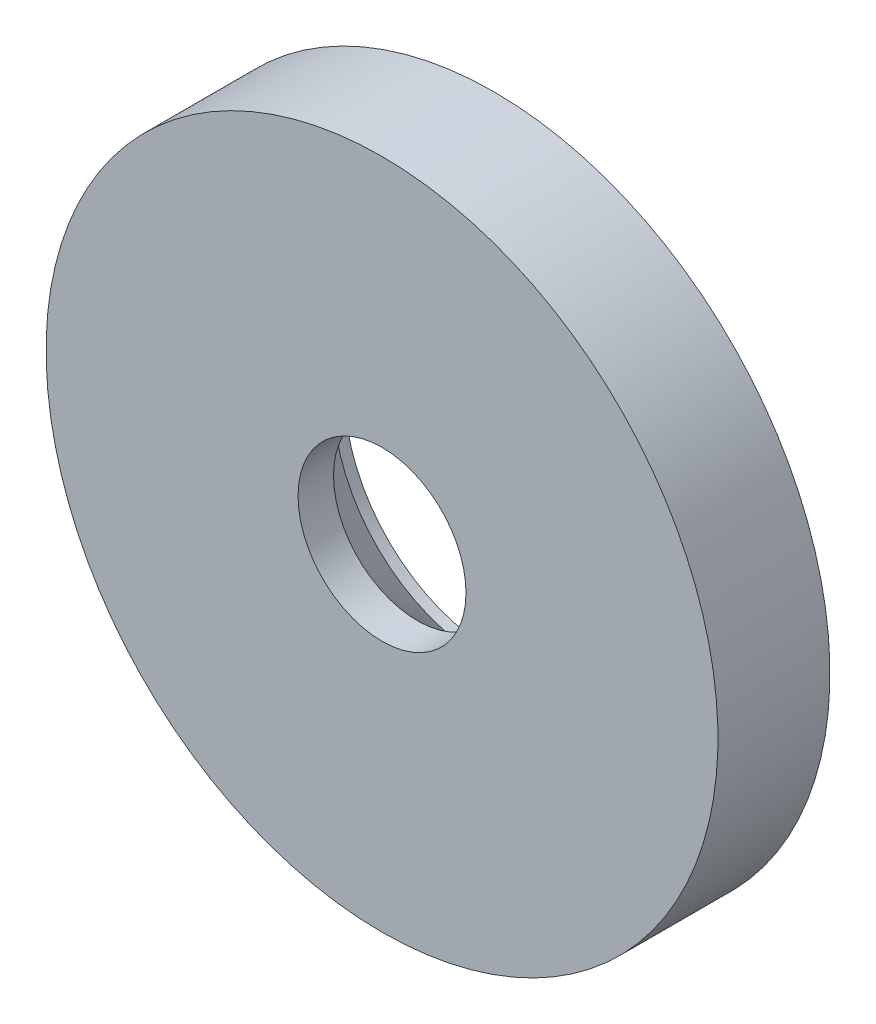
ISO-10303-21;
HEADER;
FILE_DESCRIPTION(('STEP AP214'),'2;1');
FILE_NAME('part.step','',(''),(''),'','','');
FILE_SCHEMA(('AUTOMOTIVE_DESIGN { 1 0 10303 214 1 1 1 1 }'));
ENDSEC;
DATA;
#1=APPLICATION_CONTEXT('core data for automotive mechanical design processes');
#2=APPLICATION_PROTOCOL_DEFINITION('international standard','automotive_design',2000,#1);
#3=PRODUCT_CONTEXT('',#1,'mechanical');
#4=PRODUCT('Part','Part','',(#3));
#5=PRODUCT_RELATED_PRODUCT_CATEGORY('part','',(#4));
#6=PRODUCT_DEFINITION_FORMATION('','',#4);
#7=PRODUCT_DEFINITION_CONTEXT('part definition',#1,'design');
#8=PRODUCT_DEFINITION('design','',#6,#7);
#9=PRODUCT_DEFINITION_SHAPE('','',#8);
#10=(LENGTH_UNIT() NAMED_UNIT(*) SI_UNIT(.MILLI.,.METRE.));
#11=(NAMED_UNIT(*) PLANE_ANGLE_UNIT() SI_UNIT($,.RADIAN.));
#12=(NAMED_UNIT(*) SI_UNIT($,.STERADIAN.) SOLID_ANGLE_UNIT());
#13=UNCERTAINTY_MEASURE_WITH_UNIT(LENGTH_MEASURE(1.E-05),#10,'distance_accuracy_value','');
#14=(GEOMETRIC_REPRESENTATION_CONTEXT(3) GLOBAL_UNCERTAINTY_ASSIGNED_CONTEXT((#13)) GLOBAL_UNIT_ASSIGNED_CONTEXT((#10,
#11,#12)) REPRESENTATION_CONTEXT('',''));
#15=CARTESIAN_POINT('',(0.,0.,0.));
#16=DIRECTION('',(0.,0.,1.));
#17=DIRECTION('',(1.,0.,0.));
#18=AXIS2_PLACEMENT_3D('',#15,#16,#17);
#19=CARTESIAN_POINT('',(0.,-38.,-165.));
#20=DIRECTION('',(0.,0.,-1.));
#21=DIRECTION('',(-1.,0.,0.));
#22=AXIS2_PLACEMENT_3D('',#19,#20,#21);
#23=CYLINDRICAL_SURFACE('',#22,2.25);
#24=CARTESIAN_POINT('',(0.,-38.,-165.));
#25=DIRECTION('',(0.,0.,1.));
#26=DIRECTION('',(1.,0.,0.));
#27=AXIS2_PLACEMENT_3D('',#24,#25,#26);
#28=CIRCLE('',#27,2.25);
#29=CARTESIAN_POINT('',(2.25000000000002,-38.,-165.));
#30=VERTEX_POINT('',#29);
#31=EDGE_CURVE('E27',#30,#30,#28,.T.);
#32=ORIENTED_EDGE('',*,*,#31,.T.);
#33=EDGE_LOOP('',(#32));
#34=FACE_BOUND('',#33,.T.);
#35=CARTESIAN_POINT('',(0.,-38.,-165.95));
#36=DIRECTION('',(0.,0.,-1.));
#37=DIRECTION('',(-1.,0.,0.));
#38=AXIS2_PLACEMENT_3D('',#35,#36,#37);
#39=CIRCLE('',#38,2.25);
#40=CARTESIAN_POINT('',(-2.25,-38.,-165.95));
#41=VERTEX_POINT('',#40);
#42=EDGE_CURVE('E18',#41,#41,#39,.T.);
#43=ORIENTED_EDGE('',*,*,#42,.T.);
#44=EDGE_LOOP('',(#43));
#45=FACE_BOUND('',#44,.T.);
#46=ADVANCED_FACE('F14',(#34,#45),#23,.F.);
#47=CARTESIAN_POINT('',(0.,-38.,-168.));
#48=DIRECTION('',(0.,0.,-1.));
#49=DIRECTION('',(-1.,0.,0.));
#50=AXIS2_PLACEMENT_3D('',#47,#48,#49);
#51=PLANE('',#50);
#52=CARTESIAN_POINT('',(0.,-38.,-168.));
#53=DIRECTION('',(0.,0.,-1.));
#54=DIRECTION('',(-1.,0.,0.));
#55=AXIS2_PLACEMENT_3D('',#52,#53,#54);
#56=CIRCLE('',#55,4.);
#57=CARTESIAN_POINT('',(-4.,-38.,-168.));
#58=VERTEX_POINT('',#57);
#59=EDGE_CURVE('E31',#58,#58,#56,.T.);
#60=ORIENTED_EDGE('',*,*,#59,.F.);
#61=EDGE_LOOP('',(#60));
#62=FACE_BOUND('',#61,.T.);
#63=CARTESIAN_POINT('',(0.,-38.,-168.));
#64=DIRECTION('',(0.,0.,-1.));
#65=DIRECTION('',(0.,1.,0.));
#66=AXIS2_PLACEMENT_3D('',#63,#64,#65);
#67=CIRCLE('',#66,9.);
#68=CARTESIAN_POINT('',(0.,-29.,-168.));
#69=VERTEX_POINT('',#68);
#70=EDGE_CURVE('E10',#69,#69,#67,.T.);
#71=ORIENTED_EDGE('',*,*,#70,.T.);
#72=EDGE_LOOP('',(#71));
#73=FACE_BOUND('',#72,.T.);
#74=ADVANCED_FACE('F55',(#62,#73),#51,.T.);
#75=CARTESIAN_POINT('',(0.,-38.,-165.));
#76=DIRECTION('',(0.,0.,-1.));
#77=DIRECTION('',(-1.,0.,0.));
#78=AXIS2_PLACEMENT_3D('',#75,#76,#77);
#79=PLANE('',#78);
#80=CARTESIAN_POINT('',(0.,-38.,-165.));
#81=DIRECTION('',(0.,0.,-1.));
#82=DIRECTION('',(0.,1.,0.));
#83=AXIS2_PLACEMENT_3D('',#80,#81,#82);
#84=CIRCLE('',#83,9.);
#85=CARTESIAN_POINT('',(0.,-29.,-165.));
#86=VERTEX_POINT('',#85);
#87=EDGE_CURVE('E22',#86,#86,#84,.T.);
#88=ORIENTED_EDGE('',*,*,#87,.F.);
#89=EDGE_LOOP('',(#88));
#90=FACE_BOUND('',#89,.T.);
#91=ORIENTED_EDGE('',*,*,#31,.F.);
#92=EDGE_LOOP('',(#91));
#93=FACE_BOUND('',#92,.T.);
#94=ADVANCED_FACE('F51',(#90,#93),#79,.F.);
#95=CARTESIAN_POINT('',(0.,-38.,-168.));
#96=DIRECTION('',(0.,0.,1.));
#97=DIRECTION('',(1.,0.,0.));
#98=AXIS2_PLACEMENT_3D('',#95,#96,#97);
#99=CYLINDRICAL_SURFACE('',#98,9.);
#100=ORIENTED_EDGE('',*,*,#70,.F.);
#101=EDGE_LOOP('',(#100));
#102=FACE_BOUND('',#101,.T.);
#103=ORIENTED_EDGE('',*,*,#87,.T.);
#104=EDGE_LOOP('',(#103));
#105=FACE_BOUND('',#104,.T.);
#106=ADVANCED_FACE('F16',(#102,#105),#99,.T.);
#107=CARTESIAN_POINT('',(0.,-38.,-168.));
#108=DIRECTION('',(0.,0.,1.));
#109=DIRECTION('',(1.,0.,0.));
#110=AXIS2_PLACEMENT_3D('',#107,#108,#109);
#111=CYLINDRICAL_SURFACE('',#110,4.);
#112=ORIENTED_EDGE('',*,*,#59,.T.);
#113=EDGE_LOOP('',(#112));
#114=FACE_BOUND('',#113,.T.);
#115=CARTESIAN_POINT('',(0.,-38.,-167.7));
#116=DIRECTION('',(0.,0.,-1.));
#117=DIRECTION('',(-1.,0.,0.));
#118=AXIS2_PLACEMENT_3D('',#115,#116,#117);
#119=CIRCLE('',#118,4.);
#120=CARTESIAN_POINT('',(-4.,-38.,-167.7));
#121=VERTEX_POINT('',#120);
#122=EDGE_CURVE('E34',#121,#121,#119,.T.);
#123=ORIENTED_EDGE('',*,*,#122,.F.);
#124=EDGE_LOOP('',(#123));
#125=FACE_BOUND('',#124,.T.);
#126=ADVANCED_FACE('F40',(#114,#125),#111,.F.);
#127=CARTESIAN_POINT('',(0.,-38.,-165.7));
#128=DIRECTION('',(0.,0.,-1.));
#129=DIRECTION('',(1.,0.,0.));
#130=AXIS2_PLACEMENT_3D('',#127,#128,#129);
#131=CONICAL_SURFACE('',#130,2.,0.785398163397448);
#132=ORIENTED_EDGE('',*,*,#42,.F.);
#133=EDGE_LOOP('',(#132));
#134=FACE_BOUND('',#133,.T.);
#135=ORIENTED_EDGE('',*,*,#122,.T.);
#136=EDGE_LOOP('',(#135));
#137=FACE_BOUND('',#136,.T.);
#138=ADVANCED_FACE('F38',(#134,#137),#131,.F.);
#139=CLOSED_SHELL('',(#46,#74,#94,#106,#126,#138));
#140=MANIFOLD_SOLID_BREP('B1',#139);
#141=ADVANCED_BREP_SHAPE_REPRESENTATION('',(#18,#140),#14);
#142=SHAPE_DEFINITION_REPRESENTATION(#9,#141);
ENDSEC;
END-ISO-10303-21;
